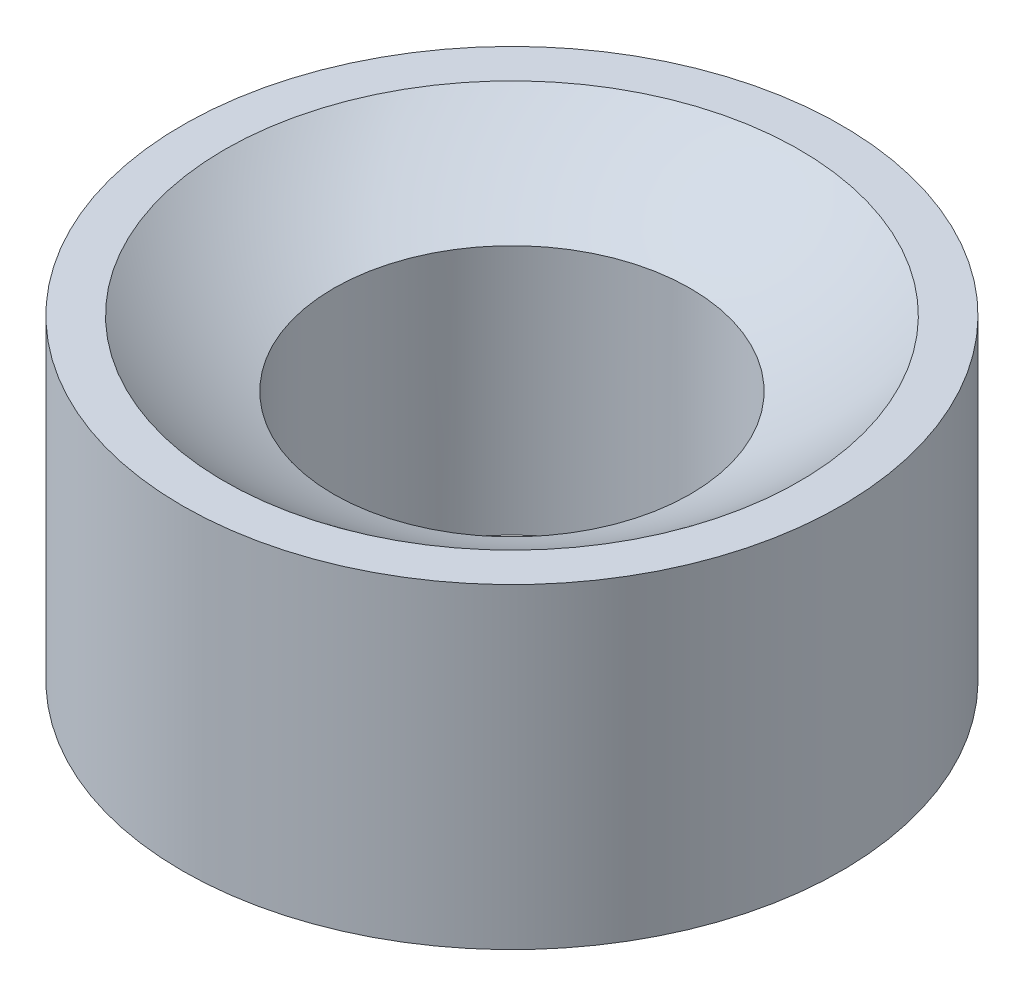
from build123d import *


with BuildPart() as part:
    # Esquisse2 → Base-R_volution (revolve)
    with BuildSketch(Plane.XY, mode=Mode.PRIVATE) as base_r_volution_sk:
        with BuildLine():
            Line((468.580237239, 254.303127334), (468.580237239, 263.238483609))
            ThreePointArc((468.580237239, 263.238483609), (466.553228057, 264.272151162), (464.690237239, 265.578481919))
            Line((464.690237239, 265.578481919), (463.186211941, 265.578481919))
            Line((463.186211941, 265.578481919), (463.186211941, 254.303127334))
            Line((463.186211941, 254.303127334), (468.580237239, 254.303127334))
        make_face()
    revolve(base_r_volution_sk.sketch.rotate(Axis((474.940237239, 265.578481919, 0), (0, -1, 0)), 270), axis=Axis((474.940237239, 265.578481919, 0), (0, -1, 0)))


solid = part.part
